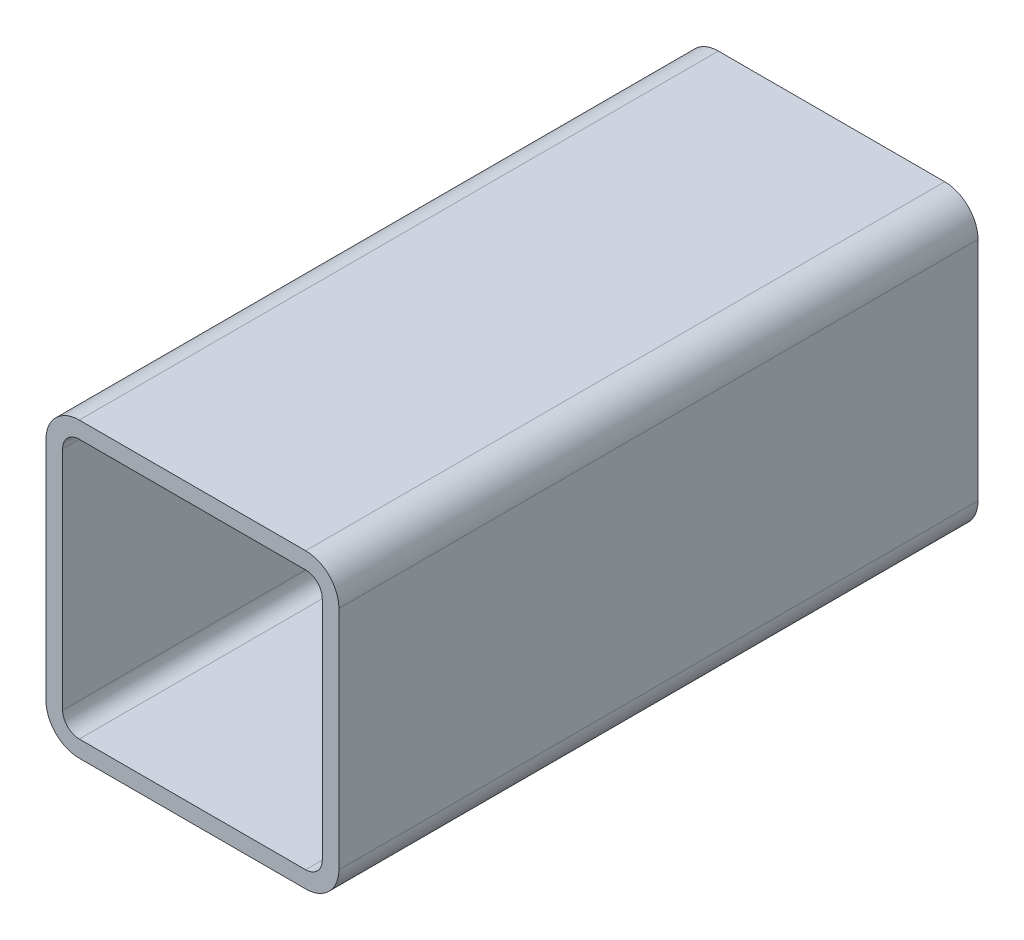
ISO-10303-21;
HEADER;
FILE_DESCRIPTION(('STEP AP214'),'2;1');
FILE_NAME('part.step','',(''),(''),'','','');
FILE_SCHEMA(('AUTOMOTIVE_DESIGN { 1 0 10303 214 1 1 1 1 }'));
ENDSEC;
DATA;
#1=APPLICATION_CONTEXT('core data for automotive mechanical design processes');
#2=APPLICATION_PROTOCOL_DEFINITION('international standard','automotive_design',2000,#1);
#3=PRODUCT_CONTEXT('',#1,'mechanical');
#4=PRODUCT('Part','Part','',(#3));
#5=PRODUCT_RELATED_PRODUCT_CATEGORY('part','',(#4));
#6=PRODUCT_DEFINITION_FORMATION('','',#4);
#7=PRODUCT_DEFINITION_CONTEXT('part definition',#1,'design');
#8=PRODUCT_DEFINITION('design','',#6,#7);
#9=PRODUCT_DEFINITION_SHAPE('','',#8);
#10=(LENGTH_UNIT() NAMED_UNIT(*) SI_UNIT(.MILLI.,.METRE.));
#11=(NAMED_UNIT(*) PLANE_ANGLE_UNIT() SI_UNIT($,.RADIAN.));
#12=(NAMED_UNIT(*) SI_UNIT($,.STERADIAN.) SOLID_ANGLE_UNIT());
#13=UNCERTAINTY_MEASURE_WITH_UNIT(LENGTH_MEASURE(1.E-05),#10,'distance_accuracy_value','');
#14=(GEOMETRIC_REPRESENTATION_CONTEXT(3) GLOBAL_UNCERTAINTY_ASSIGNED_CONTEXT((#13)) GLOBAL_UNIT_ASSIGNED_CONTEXT((#10,
#11,#12)) REPRESENTATION_CONTEXT('',''));
#15=CARTESIAN_POINT('',(0.,0.,0.));
#16=DIRECTION('',(0.,0.,1.));
#17=DIRECTION('',(1.,0.,0.));
#18=AXIS2_PLACEMENT_3D('',#15,#16,#17);
#19=CARTESIAN_POINT('',(16.3292705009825,124.580693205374,304.8));
#20=DIRECTION('',(0.,0.,1.));
#21=DIRECTION('',(1.,0.,0.));
#22=AXIS2_PLACEMENT_3D('',#19,#20,#21);
#23=PLANE('',#22);
#24=CARTESIAN_POINT('',(16.3292705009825,124.580693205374,304.8));
#25=DIRECTION('',(0.,0.,1.));
#26=DIRECTION('',(1.,0.,0.));
#27=AXIS2_PLACEMENT_3D('',#24,#25,#26);
#28=CIRCLE('',#27,15.875);
#29=CARTESIAN_POINT('',(16.3292705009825,140.455693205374,304.8));
#30=VERTEX_POINT('',#29);
#31=CARTESIAN_POINT('',(0.454270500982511,124.580693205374,304.8));
#32=VERTEX_POINT('',#31);
#33=EDGE_CURVE('E211',#30,#32,#28,.T.);
#34=ORIENTED_EDGE('',*,*,#33,.T.);
#35=DIRECTION('',(0.,-1.,0.));
#36=VECTOR('',#35,1.);
#37=CARTESIAN_POINT('',(0.454270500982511,16.6306932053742,304.8));
#38=LINE('',#37,#36);
#39=CARTESIAN_POINT('',(0.454270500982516,16.6306932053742,304.8));
#40=VERTEX_POINT('',#39);
#41=EDGE_CURVE('E214',#32,#40,#38,.T.);
#42=ORIENTED_EDGE('',*,*,#41,.T.);
#43=CARTESIAN_POINT('',(16.3292705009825,16.6306932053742,304.8));
#44=DIRECTION('',(0.,0.,1.));
#45=DIRECTION('',(1.,0.,0.));
#46=AXIS2_PLACEMENT_3D('',#43,#44,#45);
#47=CIRCLE('',#46,15.875);
#48=CARTESIAN_POINT('',(16.3292705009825,0.755693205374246,304.8));
#49=VERTEX_POINT('',#48);
#50=EDGE_CURVE('E217',#40,#49,#47,.T.);
#51=ORIENTED_EDGE('',*,*,#50,.T.);
#52=DIRECTION('',(1.,0.,0.));
#53=VECTOR('',#52,1.);
#54=CARTESIAN_POINT('',(124.279270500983,0.755693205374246,304.8));
#55=LINE('',#54,#53);
#56=CARTESIAN_POINT('',(124.279270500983,0.755693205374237,304.8));
#57=VERTEX_POINT('',#56);
#58=EDGE_CURVE('E219',#49,#57,#55,.T.);
#59=ORIENTED_EDGE('',*,*,#58,.T.);
#60=CARTESIAN_POINT('',(124.279270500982,16.6306932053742,304.8));
#61=DIRECTION('',(0.,0.,1.));
#62=DIRECTION('',(1.,0.,0.));
#63=AXIS2_PLACEMENT_3D('',#60,#61,#62);
#64=CIRCLE('',#63,15.875);
#65=CARTESIAN_POINT('',(140.154270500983,16.6306932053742,304.8));
#66=VERTEX_POINT('',#65);
#67=EDGE_CURVE('E221',#57,#66,#64,.T.);
#68=ORIENTED_EDGE('',*,*,#67,.T.);
#69=DIRECTION('',(0.,1.,0.));
#70=VECTOR('',#69,1.);
#71=CARTESIAN_POINT('',(140.154270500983,124.580693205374,304.8));
#72=LINE('',#71,#70);
#73=CARTESIAN_POINT('',(140.154270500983,124.580693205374,304.8));
#74=VERTEX_POINT('',#73);
#75=EDGE_CURVE('E223',#66,#74,#72,.T.);
#76=ORIENTED_EDGE('',*,*,#75,.T.);
#77=CARTESIAN_POINT('',(124.279270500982,124.580693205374,304.8));
#78=DIRECTION('',(0.,0.,1.));
#79=DIRECTION('',(1.,0.,0.));
#80=AXIS2_PLACEMENT_3D('',#77,#78,#79);
#81=CIRCLE('',#80,15.875);
#82=CARTESIAN_POINT('',(124.279270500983,140.455693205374,304.8));
#83=VERTEX_POINT('',#82);
#84=EDGE_CURVE('E225',#74,#83,#81,.T.);
#85=ORIENTED_EDGE('',*,*,#84,.T.);
#86=DIRECTION('',(-1.,0.,0.));
#87=VECTOR('',#86,1.);
#88=CARTESIAN_POINT('',(16.3292705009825,140.455693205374,304.8));
#89=LINE('',#88,#87);
#90=EDGE_CURVE('E227',#83,#30,#89,.T.);
#91=ORIENTED_EDGE('',*,*,#90,.T.);
#92=EDGE_LOOP('',(#34,#42,#51,#59,#68,#76,#85,#91));
#93=FACE_BOUND('',#92,.T.);
#94=DIRECTION('',(0.,-1.,0.));
#95=VECTOR('',#94,1.);
#96=CARTESIAN_POINT('',(8.39177050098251,16.6306932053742,304.8));
#97=LINE('',#96,#95);
#98=CARTESIAN_POINT('',(8.39177050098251,124.580693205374,304.8));
#99=VERTEX_POINT('',#98);
#100=CARTESIAN_POINT('',(8.39177050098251,16.6306932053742,304.8));
#101=VERTEX_POINT('',#100);
#102=EDGE_CURVE('E154',#99,#101,#97,.T.);
#103=ORIENTED_EDGE('',*,*,#102,.F.);
#104=CARTESIAN_POINT('',(16.3292705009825,124.580693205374,304.8));
#105=DIRECTION('',(0.,0.,1.));
#106=DIRECTION('',(1.,0.,0.));
#107=AXIS2_PLACEMENT_3D('',#104,#105,#106);
#108=CIRCLE('',#107,7.93750000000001);
#109=CARTESIAN_POINT('',(16.3292705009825,132.518193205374,304.8));
#110=VERTEX_POINT('',#109);
#111=EDGE_CURVE('E146',#110,#99,#108,.T.);
#112=ORIENTED_EDGE('',*,*,#111,.F.);
#113=DIRECTION('',(-1.,0.,0.));
#114=VECTOR('',#113,1.);
#115=CARTESIAN_POINT('',(16.3292705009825,132.518193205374,304.8));
#116=LINE('',#115,#114);
#117=CARTESIAN_POINT('',(124.279270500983,132.518193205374,304.8));
#118=VERTEX_POINT('',#117);
#119=EDGE_CURVE('E179',#118,#110,#116,.T.);
#120=ORIENTED_EDGE('',*,*,#119,.F.);
#121=CARTESIAN_POINT('',(124.279270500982,124.580693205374,304.8));
#122=DIRECTION('',(0.,0.,1.));
#123=DIRECTION('',(1.,0.,0.));
#124=AXIS2_PLACEMENT_3D('',#121,#122,#123);
#125=CIRCLE('',#124,7.93750000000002);
#126=CARTESIAN_POINT('',(132.216770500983,124.580693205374,304.8));
#127=VERTEX_POINT('',#126);
#128=EDGE_CURVE('E177',#127,#118,#125,.T.);
#129=ORIENTED_EDGE('',*,*,#128,.F.);
#130=DIRECTION('',(0.,1.,0.));
#131=VECTOR('',#130,1.);
#132=CARTESIAN_POINT('',(132.216770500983,124.580693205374,304.8));
#133=LINE('',#132,#131);
#134=CARTESIAN_POINT('',(132.216770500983,16.6306932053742,304.8));
#135=VERTEX_POINT('',#134);
#136=EDGE_CURVE('E175',#135,#127,#133,.T.);
#137=ORIENTED_EDGE('',*,*,#136,.F.);
#138=CARTESIAN_POINT('',(124.279270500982,16.6306932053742,304.8));
#139=DIRECTION('',(0.,0.,1.));
#140=DIRECTION('',(1.,0.,0.));
#141=AXIS2_PLACEMENT_3D('',#138,#139,#140);
#142=CIRCLE('',#141,7.93750000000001);
#143=CARTESIAN_POINT('',(124.279270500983,8.69319320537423,304.8));
#144=VERTEX_POINT('',#143);
#145=EDGE_CURVE('E173',#144,#135,#142,.T.);
#146=ORIENTED_EDGE('',*,*,#145,.F.);
#147=DIRECTION('',(1.,0.,0.));
#148=VECTOR('',#147,1.);
#149=CARTESIAN_POINT('',(124.279270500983,8.69319320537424,304.8));
#150=LINE('',#149,#148);
#151=CARTESIAN_POINT('',(16.3292705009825,8.69319320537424,304.8));
#152=VERTEX_POINT('',#151);
#153=EDGE_CURVE('E169',#152,#144,#150,.T.);
#154=ORIENTED_EDGE('',*,*,#153,.F.);
#155=CARTESIAN_POINT('',(16.3292705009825,16.6306932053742,304.8));
#156=DIRECTION('',(0.,0.,1.));
#157=DIRECTION('',(1.,0.,0.));
#158=AXIS2_PLACEMENT_3D('',#155,#156,#157);
#159=CIRCLE('',#158,7.9375);
#160=EDGE_CURVE('E167',#101,#152,#159,.T.);
#161=ORIENTED_EDGE('',*,*,#160,.F.);
#162=EDGE_LOOP('',(#103,#112,#120,#129,#137,#146,#154,#161));
#163=FACE_BOUND('',#162,.T.);
#164=ADVANCED_FACE('F33',(#93,#163),#23,.T.);
#165=CARTESIAN_POINT('',(16.3292705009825,124.580693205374,0.));
#166=DIRECTION('',(0.,0.,1.));
#167=DIRECTION('',(1.,0.,0.));
#168=AXIS2_PLACEMENT_3D('',#165,#166,#167);
#169=PLANE('',#168);
#170=CARTESIAN_POINT('',(16.3292705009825,124.580693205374,0.));
#171=DIRECTION('',(0.,0.,1.));
#172=DIRECTION('',(1.,0.,0.));
#173=AXIS2_PLACEMENT_3D('',#170,#171,#172);
#174=CIRCLE('',#173,15.875);
#175=CARTESIAN_POINT('',(16.3292705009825,140.455693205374,0.));
#176=VERTEX_POINT('',#175);
#177=CARTESIAN_POINT('',(0.454270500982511,124.580693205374,0.));
#178=VERTEX_POINT('',#177);
#179=EDGE_CURVE('E162',#176,#178,#174,.T.);
#180=ORIENTED_EDGE('',*,*,#179,.F.);
#181=DIRECTION('',(-1.,0.,0.));
#182=VECTOR('',#181,1.);
#183=CARTESIAN_POINT('',(16.3292705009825,140.455693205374,0.));
#184=LINE('',#183,#182);
#185=CARTESIAN_POINT('',(124.279270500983,140.455693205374,0.));
#186=VERTEX_POINT('',#185);
#187=EDGE_CURVE('E215',#186,#176,#184,.T.);
#188=ORIENTED_EDGE('',*,*,#187,.F.);
#189=CARTESIAN_POINT('',(124.279270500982,124.580693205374,0.));
#190=DIRECTION('',(0.,0.,1.));
#191=DIRECTION('',(1.,0.,0.));
#192=AXIS2_PLACEMENT_3D('',#189,#190,#191);
#193=CIRCLE('',#192,15.875);
#194=CARTESIAN_POINT('',(140.154270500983,124.580693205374,0.));
#195=VERTEX_POINT('',#194);
#196=EDGE_CURVE('E242',#195,#186,#193,.T.);
#197=ORIENTED_EDGE('',*,*,#196,.F.);
#198=DIRECTION('',(0.,1.,0.));
#199=VECTOR('',#198,1.);
#200=CARTESIAN_POINT('',(140.154270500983,124.580693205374,0.));
#201=LINE('',#200,#199);
#202=CARTESIAN_POINT('',(140.154270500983,16.6306932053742,0.));
#203=VERTEX_POINT('',#202);
#204=EDGE_CURVE('E240',#203,#195,#201,.T.);
#205=ORIENTED_EDGE('',*,*,#204,.F.);
#206=CARTESIAN_POINT('',(124.279270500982,16.6306932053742,0.));
#207=DIRECTION('',(0.,0.,1.));
#208=DIRECTION('',(1.,0.,0.));
#209=AXIS2_PLACEMENT_3D('',#206,#207,#208);
#210=CIRCLE('',#209,15.875);
#211=CARTESIAN_POINT('',(124.279270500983,0.755693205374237,0.));
#212=VERTEX_POINT('',#211);
#213=EDGE_CURVE('E238',#212,#203,#210,.T.);
#214=ORIENTED_EDGE('',*,*,#213,.F.);
#215=DIRECTION('',(1.,0.,0.));
#216=VECTOR('',#215,1.);
#217=CARTESIAN_POINT('',(124.279270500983,0.755693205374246,0.));
#218=LINE('',#217,#216);
#219=CARTESIAN_POINT('',(16.3292705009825,0.755693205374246,0.));
#220=VERTEX_POINT('',#219);
#221=EDGE_CURVE('E236',#220,#212,#218,.T.);
#222=ORIENTED_EDGE('',*,*,#221,.F.);
#223=CARTESIAN_POINT('',(16.3292705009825,16.6306932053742,0.));
#224=DIRECTION('',(0.,0.,1.));
#225=DIRECTION('',(1.,0.,0.));
#226=AXIS2_PLACEMENT_3D('',#223,#224,#225);
#227=CIRCLE('',#226,15.875);
#228=CARTESIAN_POINT('',(0.454270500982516,16.6306932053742,0.));
#229=VERTEX_POINT('',#228);
#230=EDGE_CURVE('E234',#229,#220,#227,.T.);
#231=ORIENTED_EDGE('',*,*,#230,.F.);
#232=DIRECTION('',(0.,-1.,0.));
#233=VECTOR('',#232,1.);
#234=CARTESIAN_POINT('',(0.454270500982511,16.6306932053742,0.));
#235=LINE('',#234,#233);
#236=EDGE_CURVE('E232',#178,#229,#235,.T.);
#237=ORIENTED_EDGE('',*,*,#236,.F.);
#238=EDGE_LOOP('',(#180,#188,#197,#205,#214,#222,#231,#237));
#239=FACE_BOUND('',#238,.T.);
#240=CARTESIAN_POINT('',(16.3292705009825,124.580693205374,0.));
#241=DIRECTION('',(0.,0.,1.));
#242=DIRECTION('',(1.,0.,0.));
#243=AXIS2_PLACEMENT_3D('',#240,#241,#242);
#244=CIRCLE('',#243,7.93750000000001);
#245=CARTESIAN_POINT('',(16.3292705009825,132.518193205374,0.));
#246=VERTEX_POINT('',#245);
#247=CARTESIAN_POINT('',(8.39177050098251,124.580693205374,0.));
#248=VERTEX_POINT('',#247);
#249=EDGE_CURVE('E56',#246,#248,#244,.T.);
#250=ORIENTED_EDGE('',*,*,#249,.T.);
#251=DIRECTION('',(0.,-1.,0.));
#252=VECTOR('',#251,1.);
#253=CARTESIAN_POINT('',(8.39177050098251,16.6306932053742,0.));
#254=LINE('',#253,#252);
#255=CARTESIAN_POINT('',(8.39177050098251,16.6306932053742,0.));
#256=VERTEX_POINT('',#255);
#257=EDGE_CURVE('E161',#248,#256,#254,.T.);
#258=ORIENTED_EDGE('',*,*,#257,.T.);
#259=CARTESIAN_POINT('',(16.3292705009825,16.6306932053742,0.));
#260=DIRECTION('',(0.,0.,1.));
#261=DIRECTION('',(1.,0.,0.));
#262=AXIS2_PLACEMENT_3D('',#259,#260,#261);
#263=CIRCLE('',#262,7.9375);
#264=CARTESIAN_POINT('',(16.3292705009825,8.69319320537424,0.));
#265=VERTEX_POINT('',#264);
#266=EDGE_CURVE('E183',#256,#265,#263,.T.);
#267=ORIENTED_EDGE('',*,*,#266,.T.);
#268=DIRECTION('',(1.,0.,0.));
#269=VECTOR('',#268,1.);
#270=CARTESIAN_POINT('',(124.279270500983,8.69319320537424,0.));
#271=LINE('',#270,#269);
#272=CARTESIAN_POINT('',(124.279270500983,8.69319320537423,0.));
#273=VERTEX_POINT('',#272);
#274=EDGE_CURVE('E186',#265,#273,#271,.T.);
#275=ORIENTED_EDGE('',*,*,#274,.T.);
#276=CARTESIAN_POINT('',(124.279270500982,16.6306932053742,0.));
#277=DIRECTION('',(0.,0.,1.));
#278=DIRECTION('',(1.,0.,0.));
#279=AXIS2_PLACEMENT_3D('',#276,#277,#278);
#280=CIRCLE('',#279,7.93750000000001);
#281=CARTESIAN_POINT('',(132.216770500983,16.6306932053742,0.));
#282=VERTEX_POINT('',#281);
#283=EDGE_CURVE('E189',#273,#282,#280,.T.);
#284=ORIENTED_EDGE('',*,*,#283,.T.);
#285=DIRECTION('',(0.,1.,0.));
#286=VECTOR('',#285,1.);
#287=CARTESIAN_POINT('',(132.216770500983,124.580693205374,0.));
#288=LINE('',#287,#286);
#289=CARTESIAN_POINT('',(132.216770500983,124.580693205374,0.));
#290=VERTEX_POINT('',#289);
#291=EDGE_CURVE('E192',#282,#290,#288,.T.);
#292=ORIENTED_EDGE('',*,*,#291,.T.);
#293=CARTESIAN_POINT('',(124.279270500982,124.580693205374,0.));
#294=DIRECTION('',(0.,0.,1.));
#295=DIRECTION('',(1.,0.,0.));
#296=AXIS2_PLACEMENT_3D('',#293,#294,#295);
#297=CIRCLE('',#296,7.93750000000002);
#298=CARTESIAN_POINT('',(124.279270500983,132.518193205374,0.));
#299=VERTEX_POINT('',#298);
#300=EDGE_CURVE('E195',#290,#299,#297,.T.);
#301=ORIENTED_EDGE('',*,*,#300,.T.);
#302=DIRECTION('',(-1.,0.,0.));
#303=VECTOR('',#302,1.);
#304=CARTESIAN_POINT('',(16.3292705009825,132.518193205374,0.));
#305=LINE('',#304,#303);
#306=EDGE_CURVE('E155',#299,#246,#305,.T.);
#307=ORIENTED_EDGE('',*,*,#306,.T.);
#308=EDGE_LOOP('',(#250,#258,#267,#275,#284,#292,#301,#307));
#309=FACE_BOUND('',#308,.T.);
#310=ADVANCED_FACE('F272',(#239,#309),#169,.F.);
#311=CARTESIAN_POINT('',(16.3292705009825,124.580693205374,304.8));
#312=DIRECTION('',(0.,0.,-1.));
#313=DIRECTION('',(-1.,0.,0.));
#314=AXIS2_PLACEMENT_3D('',#311,#312,#313);
#315=CYLINDRICAL_SURFACE('',#314,15.875);
#316=ORIENTED_EDGE('',*,*,#179,.T.);
#317=DIRECTION('',(0.,0.,-1.));
#318=VECTOR('',#317,1.);
#319=CARTESIAN_POINT('',(0.454270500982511,124.580693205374,304.8));
#320=LINE('',#319,#318);
#321=EDGE_CURVE('E11',#32,#178,#320,.T.);
#322=ORIENTED_EDGE('',*,*,#321,.F.);
#323=ORIENTED_EDGE('',*,*,#33,.F.);
#324=DIRECTION('',(0.,0.,-1.));
#325=VECTOR('',#324,1.);
#326=CARTESIAN_POINT('',(16.3292705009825,140.455693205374,304.8));
#327=LINE('',#326,#325);
#328=EDGE_CURVE('E229',#30,#176,#327,.T.);
#329=ORIENTED_EDGE('',*,*,#328,.T.);
#330=EDGE_LOOP('',(#316,#322,#323,#329));
#331=FACE_BOUND('',#330,.T.);
#332=ADVANCED_FACE('F35',(#331),#315,.T.);
#333=CARTESIAN_POINT('',(0.454270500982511,16.6306932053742,304.8));
#334=DIRECTION('',(1.,0.,0.));
#335=DIRECTION('',(0.,0.,-1.));
#336=AXIS2_PLACEMENT_3D('',#333,#334,#335);
#337=PLANE('',#336);
#338=ORIENTED_EDGE('',*,*,#236,.T.);
#339=DIRECTION('',(0.,0.,-1.));
#340=VECTOR('',#339,1.);
#341=CARTESIAN_POINT('',(0.454270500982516,16.6306932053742,304.8));
#342=LINE('',#341,#340);
#343=EDGE_CURVE('E41',#40,#229,#342,.T.);
#344=ORIENTED_EDGE('',*,*,#343,.F.);
#345=ORIENTED_EDGE('',*,*,#41,.F.);
#346=ORIENTED_EDGE('',*,*,#321,.T.);
#347=EDGE_LOOP('',(#338,#344,#345,#346));
#348=FACE_BOUND('',#347,.T.);
#349=ADVANCED_FACE('F289',(#348),#337,.F.);
#350=CARTESIAN_POINT('',(16.3292705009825,16.6306932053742,304.8));
#351=DIRECTION('',(0.,0.,-1.));
#352=DIRECTION('',(-1.,0.,0.));
#353=AXIS2_PLACEMENT_3D('',#350,#351,#352);
#354=CYLINDRICAL_SURFACE('',#353,15.875);
#355=ORIENTED_EDGE('',*,*,#230,.T.);
#356=DIRECTION('',(0.,0.,-1.));
#357=VECTOR('',#356,1.);
#358=CARTESIAN_POINT('',(16.3292705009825,0.755693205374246,304.8));
#359=LINE('',#358,#357);
#360=EDGE_CURVE('E259',#49,#220,#359,.T.);
#361=ORIENTED_EDGE('',*,*,#360,.F.);
#362=ORIENTED_EDGE('',*,*,#50,.F.);
#363=ORIENTED_EDGE('',*,*,#343,.T.);
#364=EDGE_LOOP('',(#355,#361,#362,#363));
#365=FACE_BOUND('',#364,.T.);
#366=ADVANCED_FACE('F266',(#365),#354,.T.);
#367=CARTESIAN_POINT('',(124.279270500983,0.755693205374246,304.8));
#368=DIRECTION('',(0.,1.,0.));
#369=DIRECTION('',(0.,0.,1.));
#370=AXIS2_PLACEMENT_3D('',#367,#368,#369);
#371=PLANE('',#370);
#372=ORIENTED_EDGE('',*,*,#221,.T.);
#373=DIRECTION('',(0.,0.,-1.));
#374=VECTOR('',#373,1.);
#375=CARTESIAN_POINT('',(124.279270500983,0.755693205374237,304.8));
#376=LINE('',#375,#374);
#377=EDGE_CURVE('E256',#57,#212,#376,.T.);
#378=ORIENTED_EDGE('',*,*,#377,.F.);
#379=ORIENTED_EDGE('',*,*,#58,.F.);
#380=ORIENTED_EDGE('',*,*,#360,.T.);
#381=EDGE_LOOP('',(#372,#378,#379,#380));
#382=FACE_BOUND('',#381,.T.);
#383=ADVANCED_FACE('F278',(#382),#371,.F.);
#384=CARTESIAN_POINT('',(124.279270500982,16.6306932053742,304.8));
#385=DIRECTION('',(0.,0.,-1.));
#386=DIRECTION('',(-1.,0.,0.));
#387=AXIS2_PLACEMENT_3D('',#384,#385,#386);
#388=CYLINDRICAL_SURFACE('',#387,15.875);
#389=ORIENTED_EDGE('',*,*,#213,.T.);
#390=DIRECTION('',(0.,0.,-1.));
#391=VECTOR('',#390,1.);
#392=CARTESIAN_POINT('',(140.154270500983,16.6306932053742,304.8));
#393=LINE('',#392,#391);
#394=EDGE_CURVE('E253',#66,#203,#393,.T.);
#395=ORIENTED_EDGE('',*,*,#394,.F.);
#396=ORIENTED_EDGE('',*,*,#67,.F.);
#397=ORIENTED_EDGE('',*,*,#377,.T.);
#398=EDGE_LOOP('',(#389,#395,#396,#397));
#399=FACE_BOUND('',#398,.T.);
#400=ADVANCED_FACE('F282',(#399),#388,.T.);
#401=CARTESIAN_POINT('',(140.154270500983,124.580693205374,304.8));
#402=DIRECTION('',(-1.,0.,0.));
#403=DIRECTION('',(0.,0.,1.));
#404=AXIS2_PLACEMENT_3D('',#401,#402,#403);
#405=PLANE('',#404);
#406=ORIENTED_EDGE('',*,*,#204,.T.);
#407=DIRECTION('',(0.,0.,-1.));
#408=VECTOR('',#407,1.);
#409=CARTESIAN_POINT('',(140.154270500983,124.580693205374,304.8));
#410=LINE('',#409,#408);
#411=EDGE_CURVE('E250',#74,#195,#410,.T.);
#412=ORIENTED_EDGE('',*,*,#411,.F.);
#413=ORIENTED_EDGE('',*,*,#75,.F.);
#414=ORIENTED_EDGE('',*,*,#394,.T.);
#415=EDGE_LOOP('',(#406,#412,#413,#414));
#416=FACE_BOUND('',#415,.T.);
#417=ADVANCED_FACE('F302',(#416),#405,.F.);
#418=CARTESIAN_POINT('',(124.279270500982,124.580693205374,304.8));
#419=DIRECTION('',(0.,0.,-1.));
#420=DIRECTION('',(-1.,0.,0.));
#421=AXIS2_PLACEMENT_3D('',#418,#419,#420);
#422=CYLINDRICAL_SURFACE('',#421,15.875);
#423=ORIENTED_EDGE('',*,*,#196,.T.);
#424=DIRECTION('',(0.,0.,-1.));
#425=VECTOR('',#424,1.);
#426=CARTESIAN_POINT('',(124.279270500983,140.455693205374,304.8));
#427=LINE('',#426,#425);
#428=EDGE_CURVE('E247',#83,#186,#427,.T.);
#429=ORIENTED_EDGE('',*,*,#428,.F.);
#430=ORIENTED_EDGE('',*,*,#84,.F.);
#431=ORIENTED_EDGE('',*,*,#411,.T.);
#432=EDGE_LOOP('',(#423,#429,#430,#431));
#433=FACE_BOUND('',#432,.T.);
#434=ADVANCED_FACE('F300',(#433),#422,.T.);
#435=CARTESIAN_POINT('',(16.3292705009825,140.455693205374,304.8));
#436=DIRECTION('',(0.,-1.,0.));
#437=DIRECTION('',(0.,0.,-1.));
#438=AXIS2_PLACEMENT_3D('',#435,#436,#437);
#439=PLANE('',#438);
#440=ORIENTED_EDGE('',*,*,#187,.T.);
#441=ORIENTED_EDGE('',*,*,#328,.F.);
#442=ORIENTED_EDGE('',*,*,#90,.F.);
#443=ORIENTED_EDGE('',*,*,#428,.T.);
#444=EDGE_LOOP('',(#440,#441,#442,#443));
#445=FACE_BOUND('',#444,.T.);
#446=ADVANCED_FACE('F295',(#445),#439,.F.);
#447=CARTESIAN_POINT('',(16.3292705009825,124.580693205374,304.8));
#448=DIRECTION('',(0.,0.,-1.));
#449=DIRECTION('',(-1.,0.,0.));
#450=AXIS2_PLACEMENT_3D('',#447,#448,#449);
#451=CYLINDRICAL_SURFACE('',#450,7.93750000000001);
#452=ORIENTED_EDGE('',*,*,#249,.F.);
#453=DIRECTION('',(0.,0.,-1.));
#454=VECTOR('',#453,1.);
#455=CARTESIAN_POINT('',(16.3292705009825,132.518193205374,304.8));
#456=LINE('',#455,#454);
#457=EDGE_CURVE('E150',#110,#246,#456,.T.);
#458=ORIENTED_EDGE('',*,*,#457,.F.);
#459=ORIENTED_EDGE('',*,*,#111,.T.);
#460=DIRECTION('',(0.,0.,-1.));
#461=VECTOR('',#460,1.);
#462=CARTESIAN_POINT('',(8.39177050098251,124.580693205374,304.8));
#463=LINE('',#462,#461);
#464=EDGE_CURVE('E149',#99,#248,#463,.T.);
#465=ORIENTED_EDGE('',*,*,#464,.T.);
#466=EDGE_LOOP('',(#452,#458,#459,#465));
#467=FACE_BOUND('',#466,.T.);
#468=ADVANCED_FACE('F148',(#467),#451,.F.);
#469=CARTESIAN_POINT('',(8.39177050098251,16.6306932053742,304.8));
#470=DIRECTION('',(1.,0.,0.));
#471=DIRECTION('',(0.,0.,-1.));
#472=AXIS2_PLACEMENT_3D('',#469,#470,#471);
#473=PLANE('',#472);
#474=ORIENTED_EDGE('',*,*,#257,.F.);
#475=ORIENTED_EDGE('',*,*,#464,.F.);
#476=ORIENTED_EDGE('',*,*,#102,.T.);
#477=DIRECTION('',(0.,0.,-1.));
#478=VECTOR('',#477,1.);
#479=CARTESIAN_POINT('',(8.39177050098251,16.6306932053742,304.8));
#480=LINE('',#479,#478);
#481=EDGE_CURVE('E163',#101,#256,#480,.T.);
#482=ORIENTED_EDGE('',*,*,#481,.T.);
#483=EDGE_LOOP('',(#474,#475,#476,#482));
#484=FACE_BOUND('',#483,.T.);
#485=ADVANCED_FACE('F158',(#484),#473,.T.);
#486=CARTESIAN_POINT('',(16.3292705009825,16.6306932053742,304.8));
#487=DIRECTION('',(0.,0.,-1.));
#488=DIRECTION('',(-1.,0.,0.));
#489=AXIS2_PLACEMENT_3D('',#486,#487,#488);
#490=CYLINDRICAL_SURFACE('',#489,7.9375);
#491=ORIENTED_EDGE('',*,*,#266,.F.);
#492=ORIENTED_EDGE('',*,*,#481,.F.);
#493=ORIENTED_EDGE('',*,*,#160,.T.);
#494=DIRECTION('',(0.,0.,-1.));
#495=VECTOR('',#494,1.);
#496=CARTESIAN_POINT('',(16.3292705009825,8.69319320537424,304.8));
#497=LINE('',#496,#495);
#498=EDGE_CURVE('E208',#152,#265,#497,.T.);
#499=ORIENTED_EDGE('',*,*,#498,.T.);
#500=EDGE_LOOP('',(#491,#492,#493,#499));
#501=FACE_BOUND('',#500,.T.);
#502=ADVANCED_FACE('F327',(#501),#490,.F.);
#503=CARTESIAN_POINT('',(124.279270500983,8.69319320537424,304.8));
#504=DIRECTION('',(0.,1.,0.));
#505=DIRECTION('',(0.,0.,1.));
#506=AXIS2_PLACEMENT_3D('',#503,#504,#505);
#507=PLANE('',#506);
#508=ORIENTED_EDGE('',*,*,#274,.F.);
#509=ORIENTED_EDGE('',*,*,#498,.F.);
#510=ORIENTED_EDGE('',*,*,#153,.T.);
#511=DIRECTION('',(0.,0.,-1.));
#512=VECTOR('',#511,1.);
#513=CARTESIAN_POINT('',(124.279270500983,8.69319320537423,304.8));
#514=LINE('',#513,#512);
#515=EDGE_CURVE('E206',#144,#273,#514,.T.);
#516=ORIENTED_EDGE('',*,*,#515,.T.);
#517=EDGE_LOOP('',(#508,#509,#510,#516));
#518=FACE_BOUND('',#517,.T.);
#519=ADVANCED_FACE('F331',(#518),#507,.T.);
#520=CARTESIAN_POINT('',(124.279270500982,16.6306932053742,304.8));
#521=DIRECTION('',(0.,0.,-1.));
#522=DIRECTION('',(-1.,0.,0.));
#523=AXIS2_PLACEMENT_3D('',#520,#521,#522);
#524=CYLINDRICAL_SURFACE('',#523,7.93750000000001);
#525=ORIENTED_EDGE('',*,*,#283,.F.);
#526=ORIENTED_EDGE('',*,*,#515,.F.);
#527=ORIENTED_EDGE('',*,*,#145,.T.);
#528=DIRECTION('',(0.,0.,-1.));
#529=VECTOR('',#528,1.);
#530=CARTESIAN_POINT('',(132.216770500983,16.6306932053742,304.8));
#531=LINE('',#530,#529);
#532=EDGE_CURVE('E204',#135,#282,#531,.T.);
#533=ORIENTED_EDGE('',*,*,#532,.T.);
#534=EDGE_LOOP('',(#525,#526,#527,#533));
#535=FACE_BOUND('',#534,.T.);
#536=ADVANCED_FACE('F337',(#535),#524,.F.);
#537=CARTESIAN_POINT('',(132.216770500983,124.580693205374,304.8));
#538=DIRECTION('',(-1.,0.,0.));
#539=DIRECTION('',(0.,0.,1.));
#540=AXIS2_PLACEMENT_3D('',#537,#538,#539);
#541=PLANE('',#540);
#542=ORIENTED_EDGE('',*,*,#291,.F.);
#543=ORIENTED_EDGE('',*,*,#532,.F.);
#544=ORIENTED_EDGE('',*,*,#136,.T.);
#545=DIRECTION('',(0.,0.,-1.));
#546=VECTOR('',#545,1.);
#547=CARTESIAN_POINT('',(132.216770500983,124.580693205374,304.8));
#548=LINE('',#547,#546);
#549=EDGE_CURVE('E202',#127,#290,#548,.T.);
#550=ORIENTED_EDGE('',*,*,#549,.T.);
#551=EDGE_LOOP('',(#542,#543,#544,#550));
#552=FACE_BOUND('',#551,.T.);
#553=ADVANCED_FACE('F341',(#552),#541,.T.);
#554=CARTESIAN_POINT('',(124.279270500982,124.580693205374,304.8));
#555=DIRECTION('',(0.,0.,-1.));
#556=DIRECTION('',(-1.,0.,0.));
#557=AXIS2_PLACEMENT_3D('',#554,#555,#556);
#558=CYLINDRICAL_SURFACE('',#557,7.93750000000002);
#559=ORIENTED_EDGE('',*,*,#300,.F.);
#560=ORIENTED_EDGE('',*,*,#549,.F.);
#561=ORIENTED_EDGE('',*,*,#128,.T.);
#562=DIRECTION('',(0.,0.,-1.));
#563=VECTOR('',#562,1.);
#564=CARTESIAN_POINT('',(124.279270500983,132.518193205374,304.8));
#565=LINE('',#564,#563);
#566=EDGE_CURVE('E48',#118,#299,#565,.T.);
#567=ORIENTED_EDGE('',*,*,#566,.T.);
#568=EDGE_LOOP('',(#559,#560,#561,#567));
#569=FACE_BOUND('',#568,.T.);
#570=ADVANCED_FACE('F345',(#569),#558,.F.);
#571=CARTESIAN_POINT('',(16.3292705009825,132.518193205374,304.8));
#572=DIRECTION('',(0.,-1.,0.));
#573=DIRECTION('',(0.,0.,-1.));
#574=AXIS2_PLACEMENT_3D('',#571,#572,#573);
#575=PLANE('',#574);
#576=ORIENTED_EDGE('',*,*,#306,.F.);
#577=ORIENTED_EDGE('',*,*,#566,.F.);
#578=ORIENTED_EDGE('',*,*,#119,.T.);
#579=ORIENTED_EDGE('',*,*,#457,.T.);
#580=EDGE_LOOP('',(#576,#577,#578,#579));
#581=FACE_BOUND('',#580,.T.);
#582=ADVANCED_FACE('F349',(#581),#575,.T.);
#583=CLOSED_SHELL('',(#164,#310,#332,#349,#366,#383,#400,#417,#434,#446,#468,#485,#502,#519,
#536,#553,#570,#582));
#584=MANIFOLD_SOLID_BREP('B2',#583);
#585=ADVANCED_BREP_SHAPE_REPRESENTATION('',(#18,#584),#14);
#586=SHAPE_DEFINITION_REPRESENTATION(#9,#585);
ENDSEC;
END-ISO-10303-21;
